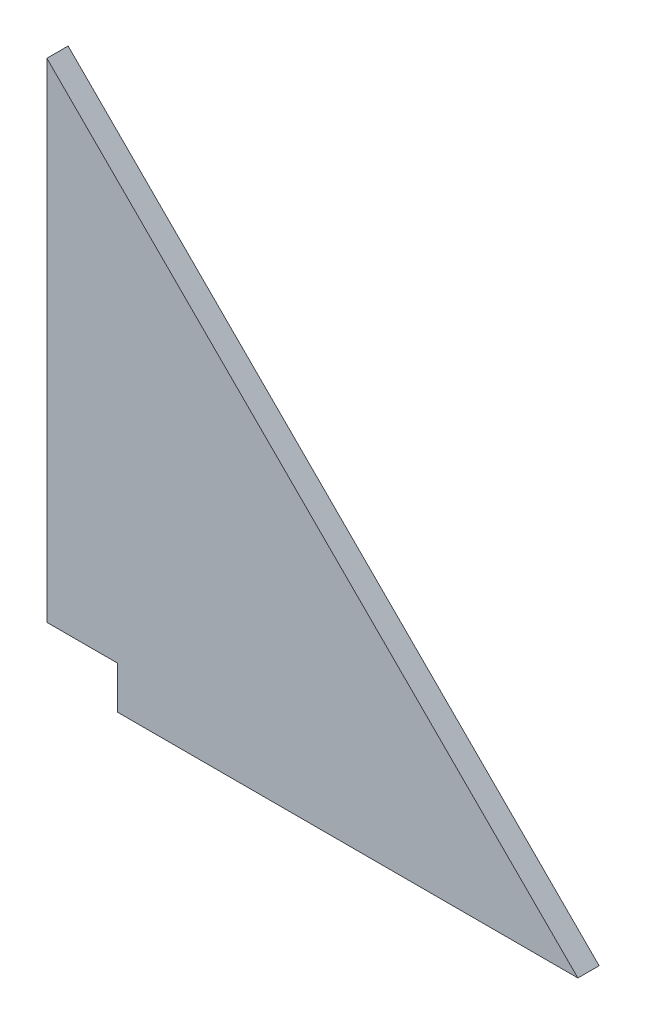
ISO-10303-21;
HEADER;
FILE_DESCRIPTION(('STEP AP214'),'2;1');
FILE_NAME('part.step','',(''),(''),'','','');
FILE_SCHEMA(('AUTOMOTIVE_DESIGN { 1 0 10303 214 1 1 1 1 }'));
ENDSEC;
DATA;
#1=APPLICATION_CONTEXT('core data for automotive mechanical design processes');
#2=APPLICATION_PROTOCOL_DEFINITION('international standard','automotive_design',2000,#1);
#3=PRODUCT_CONTEXT('',#1,'mechanical');
#4=PRODUCT('Part','Part','',(#3));
#5=PRODUCT_RELATED_PRODUCT_CATEGORY('part','',(#4));
#6=PRODUCT_DEFINITION_FORMATION('','',#4);
#7=PRODUCT_DEFINITION_CONTEXT('part definition',#1,'design');
#8=PRODUCT_DEFINITION('design','',#6,#7);
#9=PRODUCT_DEFINITION_SHAPE('','',#8);
#10=(LENGTH_UNIT() NAMED_UNIT(*) SI_UNIT(.MILLI.,.METRE.));
#11=(NAMED_UNIT(*) PLANE_ANGLE_UNIT() SI_UNIT($,.RADIAN.));
#12=(NAMED_UNIT(*) SI_UNIT($,.STERADIAN.) SOLID_ANGLE_UNIT());
#13=UNCERTAINTY_MEASURE_WITH_UNIT(LENGTH_MEASURE(1.E-05),#10,'distance_accuracy_value','');
#14=(GEOMETRIC_REPRESENTATION_CONTEXT(3) GLOBAL_UNCERTAINTY_ASSIGNED_CONTEXT((#13)) GLOBAL_UNIT_ASSIGNED_CONTEXT((#10,
#11,#12)) REPRESENTATION_CONTEXT('',''));
#15=CARTESIAN_POINT('',(0.,0.,0.));
#16=DIRECTION('',(0.,0.,1.));
#17=DIRECTION('',(1.,0.,0.));
#18=AXIS2_PLACEMENT_3D('',#15,#16,#17);
#19=CARTESIAN_POINT('',(53.501637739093,53.501637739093,6.));
#20=DIRECTION('',(0.,0.,1.));
#21=DIRECTION('',(1.,0.,0.));
#22=AXIS2_PLACEMENT_3D('',#19,#20,#21);
#23=PLANE('',#22);
#24=DIRECTION('',(1.,0.,0.));
#25=VECTOR('',#24,1.);
#26=CARTESIAN_POINT('',(0.,12.,6.));
#27=LINE('',#26,#25);
#28=CARTESIAN_POINT('',(0.,12.,6.));
#29=VERTEX_POINT('',#28);
#30=CARTESIAN_POINT('',(20.,12.,6.));
#31=VERTEX_POINT('',#30);
#32=EDGE_CURVE('E87',#29,#31,#27,.T.);
#33=ORIENTED_EDGE('',*,*,#32,.T.);
#34=DIRECTION('',(0.,-1.,0.));
#35=VECTOR('',#34,1.);
#36=CARTESIAN_POINT('',(20.,12.,6.));
#37=LINE('',#36,#35);
#38=CARTESIAN_POINT('',(20.,0.,6.));
#39=VERTEX_POINT('',#38);
#40=EDGE_CURVE('E85',#31,#39,#37,.T.);
#41=ORIENTED_EDGE('',*,*,#40,.T.);
#42=DIRECTION('',(1.,0.,0.));
#43=VECTOR('',#42,1.);
#44=CARTESIAN_POINT('',(20.,0.,6.));
#45=LINE('',#44,#43);
#46=CARTESIAN_POINT('',(150.,0.,6.));
#47=VERTEX_POINT('',#46);
#48=EDGE_CURVE('E70',#39,#47,#45,.T.);
#49=ORIENTED_EDGE('',*,*,#48,.T.);
#50=DIRECTION('',(-0.707106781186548,0.707106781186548,0.));
#51=VECTOR('',#50,1.);
#52=CARTESIAN_POINT('',(150.,0.,6.));
#53=LINE('',#52,#51);
#54=CARTESIAN_POINT('',(0.,150.,6.));
#55=VERTEX_POINT('',#54);
#56=EDGE_CURVE('E111',#47,#55,#53,.T.);
#57=ORIENTED_EDGE('',*,*,#56,.T.);
#58=DIRECTION('',(0.,-1.,0.));
#59=VECTOR('',#58,1.);
#60=CARTESIAN_POINT('',(0.,150.,6.));
#61=LINE('',#60,#59);
#62=EDGE_CURVE('E10',#55,#29,#61,.T.);
#63=ORIENTED_EDGE('',*,*,#62,.T.);
#64=EDGE_LOOP('',(#33,#41,#49,#57,#63));
#65=FACE_BOUND('',#64,.T.);
#66=ADVANCED_FACE('F16',(#65),#23,.T.);
#67=CARTESIAN_POINT('',(53.501637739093,53.501637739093,0.));
#68=DIRECTION('',(0.,0.,1.));
#69=DIRECTION('',(1.,0.,0.));
#70=AXIS2_PLACEMENT_3D('',#67,#68,#69);
#71=PLANE('',#70);
#72=DIRECTION('',(0.,-1.,0.));
#73=VECTOR('',#72,1.);
#74=CARTESIAN_POINT('',(0.,150.,0.));
#75=LINE('',#74,#73);
#76=CARTESIAN_POINT('',(0.,150.,0.));
#77=VERTEX_POINT('',#76);
#78=CARTESIAN_POINT('',(0.,12.,0.));
#79=VERTEX_POINT('',#78);
#80=EDGE_CURVE('E25',#77,#79,#75,.T.);
#81=ORIENTED_EDGE('',*,*,#80,.F.);
#82=DIRECTION('',(-0.707106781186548,0.707106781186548,0.));
#83=VECTOR('',#82,1.);
#84=CARTESIAN_POINT('',(150.,0.,0.));
#85=LINE('',#84,#83);
#86=CARTESIAN_POINT('',(150.,0.,0.));
#87=VERTEX_POINT('',#86);
#88=EDGE_CURVE('E81',#87,#77,#85,.T.);
#89=ORIENTED_EDGE('',*,*,#88,.F.);
#90=DIRECTION('',(1.,0.,0.));
#91=VECTOR('',#90,1.);
#92=CARTESIAN_POINT('',(20.,0.,0.));
#93=LINE('',#92,#91);
#94=CARTESIAN_POINT('',(20.,0.,0.));
#95=VERTEX_POINT('',#94);
#96=EDGE_CURVE('E92',#95,#87,#93,.T.);
#97=ORIENTED_EDGE('',*,*,#96,.F.);
#98=DIRECTION('',(0.,-1.,0.));
#99=VECTOR('',#98,1.);
#100=CARTESIAN_POINT('',(20.,12.,0.));
#101=LINE('',#100,#99);
#102=CARTESIAN_POINT('',(20.,12.,0.));
#103=VERTEX_POINT('',#102);
#104=EDGE_CURVE('E96',#103,#95,#101,.T.);
#105=ORIENTED_EDGE('',*,*,#104,.F.);
#106=DIRECTION('',(1.,0.,0.));
#107=VECTOR('',#106,1.);
#108=CARTESIAN_POINT('',(0.,12.,0.));
#109=LINE('',#108,#107);
#110=EDGE_CURVE('E131',#79,#103,#109,.T.);
#111=ORIENTED_EDGE('',*,*,#110,.F.);
#112=EDGE_LOOP('',(#81,#89,#97,#105,#111));
#113=FACE_BOUND('',#112,.T.);
#114=ADVANCED_FACE('F18',(#113),#71,.F.);
#115=CARTESIAN_POINT('',(0.,150.,0.));
#116=DIRECTION('',(1.,0.,0.));
#117=DIRECTION('',(0.,1.,0.));
#118=AXIS2_PLACEMENT_3D('',#115,#116,#117);
#119=PLANE('',#118);
#120=ORIENTED_EDGE('',*,*,#80,.T.);
#121=DIRECTION('',(0.,0.,1.));
#122=VECTOR('',#121,1.);
#123=CARTESIAN_POINT('',(0.,12.,0.));
#124=LINE('',#123,#122);
#125=EDGE_CURVE('E102',#79,#29,#124,.T.);
#126=ORIENTED_EDGE('',*,*,#125,.T.);
#127=ORIENTED_EDGE('',*,*,#62,.F.);
#128=DIRECTION('',(0.,0.,1.));
#129=VECTOR('',#128,1.);
#130=CARTESIAN_POINT('',(0.,150.,0.));
#131=LINE('',#130,#129);
#132=EDGE_CURVE('E115',#77,#55,#131,.T.);
#133=ORIENTED_EDGE('',*,*,#132,.F.);
#134=EDGE_LOOP('',(#120,#126,#127,#133));
#135=FACE_BOUND('',#134,.T.);
#136=ADVANCED_FACE('F122',(#135),#119,.F.);
#137=CARTESIAN_POINT('',(150.,0.,0.));
#138=DIRECTION('',(-0.707106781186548,-0.707106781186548,0.));
#139=DIRECTION('',(-0.707106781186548,0.707106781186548,0.));
#140=AXIS2_PLACEMENT_3D('',#137,#138,#139);
#141=PLANE('',#140);
#142=ORIENTED_EDGE('',*,*,#88,.T.);
#143=ORIENTED_EDGE('',*,*,#132,.T.);
#144=ORIENTED_EDGE('',*,*,#56,.F.);
#145=DIRECTION('',(0.,0.,1.));
#146=VECTOR('',#145,1.);
#147=CARTESIAN_POINT('',(150.,0.,0.));
#148=LINE('',#147,#146);
#149=EDGE_CURVE('E78',#87,#47,#148,.T.);
#150=ORIENTED_EDGE('',*,*,#149,.F.);
#151=EDGE_LOOP('',(#142,#143,#144,#150));
#152=FACE_BOUND('',#151,.T.);
#153=ADVANCED_FACE('F121',(#152),#141,.F.);
#154=CARTESIAN_POINT('',(20.,0.,0.));
#155=DIRECTION('',(0.,1.,0.));
#156=DIRECTION('',(1.,0.,0.));
#157=AXIS2_PLACEMENT_3D('',#154,#155,#156);
#158=PLANE('',#157);
#159=ORIENTED_EDGE('',*,*,#96,.T.);
#160=ORIENTED_EDGE('',*,*,#149,.T.);
#161=ORIENTED_EDGE('',*,*,#48,.F.);
#162=DIRECTION('',(0.,0.,1.));
#163=VECTOR('',#162,1.);
#164=CARTESIAN_POINT('',(20.,0.,0.));
#165=LINE('',#164,#163);
#166=EDGE_CURVE('E75',#95,#39,#165,.T.);
#167=ORIENTED_EDGE('',*,*,#166,.F.);
#168=EDGE_LOOP('',(#159,#160,#161,#167));
#169=FACE_BOUND('',#168,.T.);
#170=ADVANCED_FACE('F73',(#169),#158,.F.);
#171=CARTESIAN_POINT('',(20.,12.,0.));
#172=DIRECTION('',(1.,0.,0.));
#173=DIRECTION('',(0.,1.,0.));
#174=AXIS2_PLACEMENT_3D('',#171,#172,#173);
#175=PLANE('',#174);
#176=ORIENTED_EDGE('',*,*,#104,.T.);
#177=ORIENTED_EDGE('',*,*,#166,.T.);
#178=ORIENTED_EDGE('',*,*,#40,.F.);
#179=DIRECTION('',(0.,0.,1.));
#180=VECTOR('',#179,1.);
#181=CARTESIAN_POINT('',(20.,12.,0.));
#182=LINE('',#181,#180);
#183=EDGE_CURVE('E135',#103,#31,#182,.T.);
#184=ORIENTED_EDGE('',*,*,#183,.F.);
#185=EDGE_LOOP('',(#176,#177,#178,#184));
#186=FACE_BOUND('',#185,.T.);
#187=ADVANCED_FACE('F94',(#186),#175,.F.);
#188=CARTESIAN_POINT('',(0.,12.,0.));
#189=DIRECTION('',(0.,1.,0.));
#190=DIRECTION('',(1.,0.,0.));
#191=AXIS2_PLACEMENT_3D('',#188,#189,#190);
#192=PLANE('',#191);
#193=ORIENTED_EDGE('',*,*,#110,.T.);
#194=ORIENTED_EDGE('',*,*,#183,.T.);
#195=ORIENTED_EDGE('',*,*,#32,.F.);
#196=ORIENTED_EDGE('',*,*,#125,.F.);
#197=EDGE_LOOP('',(#193,#194,#195,#196));
#198=FACE_BOUND('',#197,.T.);
#199=ADVANCED_FACE('F130',(#198),#192,.F.);
#200=CLOSED_SHELL('',(#66,#114,#136,#153,#170,#187,#199));
#201=MANIFOLD_SOLID_BREP('B1',#200);
#202=ADVANCED_BREP_SHAPE_REPRESENTATION('',(#18,#201),#14);
#203=SHAPE_DEFINITION_REPRESENTATION(#9,#202);
ENDSEC;
END-ISO-10303-21;
